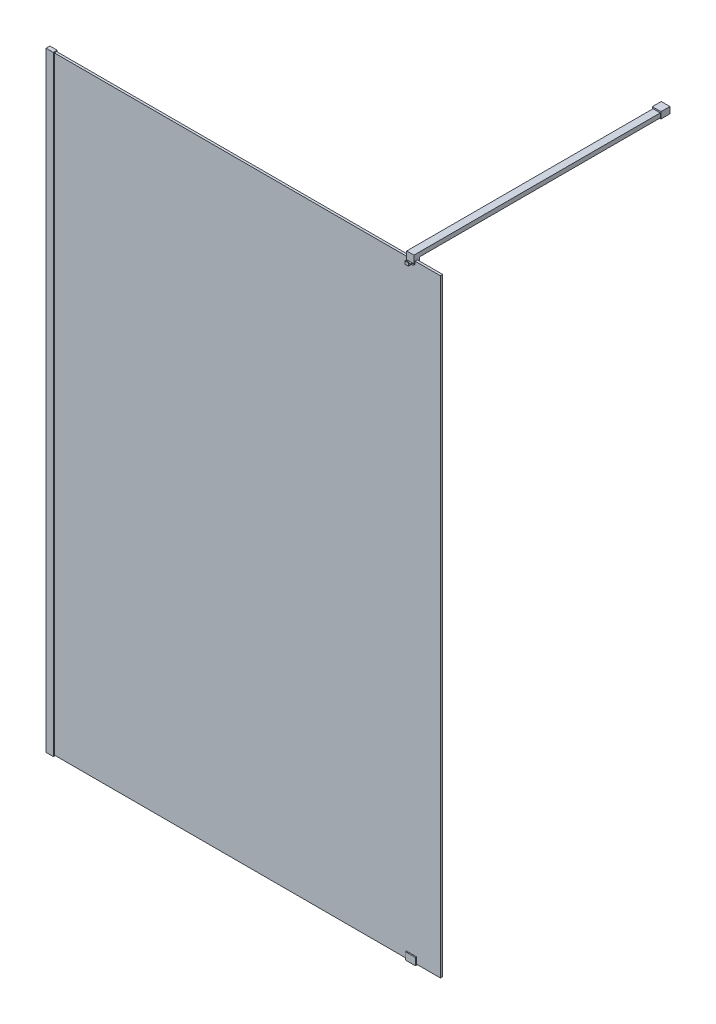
from build123d import *

# Parameters (mm, degrees)
DODANIE_WYCI_GNI_CIE1_DEPTH     = 2100
SZKIC2_W                        = 1347
SZKIC2_H                        = 8
DODANIE_WYCI_GNI_CIE2_DEPTH     = 2100
SZKIC4_W                        = 25
SZKIC4_H                        = 13.3
DODANIE_WYCI_GNI_CIE3_DEPTH     = 3
SZKIC5_W                        = 25
SZKIC5_H                        = 13.3
DODANIE_WYCI_GNI_CIE4_DEPTH     = 3
DODANIE_WYCI_GNI_CIE5_DEPTH     = 17.5
DODANIE_WYCI_GNI_CIE6_DEPTH     = 12.5
WYTNIJ_WYCI_GNI_CIE1_DEPTH      = 2504.671656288
WYTNIJ_WYCI_GNI_CIE1_DEPTH_BACK = 2504.671656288
SZKIC10_W                       = 25
SZKIC10_H                       = 861.63
DODANIE_WYCI_GNI_CIE7_DEPTH     = 15
SZKIC14_W                       = 30
SZKIC14_H                       = 22
DODANIE_WYCI_GNI_CIE8_DEPTH     = 31


with BuildPart() as part:
    # Szkic1 → Dodanie-wyci_gni_cie1 (new body)
    with BuildSketch(Plane(origin=(0, 0, 0), x_dir=(1, 0, 0), z_dir=(0, 1, 0))):
        Polygon((0, 0), (0, 13.3), (25, 13.3), (25, 11.4), (11.45, 11.4), (11.45, 3.4), (25, 3.4), (25, 0), align=None)
    extrude(amount=DODANIE_WYCI_GNI_CIE1_DEPTH)

    # Szkic4 → Dodanie-wyci_gni_cie3 (add)
    with BuildSketch(Plane(origin=(0, 2100, 0), x_dir=(1, 0, 0), z_dir=(0, 1, 0))):
        with Locations((12.5, 6.65)):
            Rectangle(SZKIC4_W, SZKIC4_H)
    extrude(amount=DODANIE_WYCI_GNI_CIE3_DEPTH)

    # Szkic5 → Dodanie-wyci_gni_cie4 (add)
    with BuildSketch(Plane.XZ):
        with Locations((12.5, -6.65)):
            Rectangle(SZKIC5_W, SZKIC5_H)
    extrude(amount=DODANIE_WYCI_GNI_CIE4_DEPTH)


with BuildPart() as body_2:
    # Szkic2 → Dodanie-wyci_gni_cie2 (new body)
    with BuildSketch(Plane.XZ):
        with Locations((684.95, -7.4)):
            Rectangle(SZKIC2_W, SZKIC2_H)
    extrude(amount=-DODANIE_WYCI_GNI_CIE2_DEPTH)


with BuildPart() as body_3:
    # Szkic6 → Dodanie-wyci_gni_cie5 (new, symmetric)
    with BuildSketch(Plane(origin=(1258.45, 0, 0), x_dir=(0, 0, -1), z_dir=(1, 0, 0))):
        Polygon((11.4, 22), (15.75, 22), (15.75, -3), (-0.35, -3), (-0.35, 22), (3.4, 22), (3.4, 0), (11.4, 0), align=None)
    extrude(amount=DODANIE_WYCI_GNI_CIE5_DEPTH, both=True)


with BuildPart() as body_4:
    # Szkic7 → Dodanie-wyci_gni_cie6 (new, symmetric)
    with BuildSketch(Plane(origin=(1258.45, 0, 0), x_dir=(0, 0, -1), z_dir=(1, 0, 0))):
        Polygon((-0.6, 2120), (19.4, 2120), (19.4, 2090), (11.4, 2090), (11.4, 2100), (3.4, 2100), (3.4, 2090), (-13.37, 2090), (-13.37, 2100), (-10.37, 2100), (-9.845068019, 2094), (-0.6, 2094), align=None)
    extrude(amount=DODANIE_WYCI_GNI_CIE6_DEPTH, both=True)

    # Szkic8 → Wytnij-wyci_gni_cie1 (cut, two sides: drawn at the far end of the back side and taken through both)
    with BuildSketch(Plane(origin=(0, 2100, 0), x_dir=(1, 0, 0), z_dir=(0, 1, 0)).offset(-WYTNIJ_WYCI_GNI_CIE1_DEPTH_BACK)):
        Polygon((-1067.142061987, 1078.012542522), (1245.95, -0.6), (1252.45, -3.630999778), (1252.45, -13.37), (1264.45, -13.37), (1264.45, -3.630999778), (1270.95, -0.6), (3584.042061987, 1078.012542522), (3584.042061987, -4026.416868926), (-1067.142061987, -4026.416868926), align=None)
    extrude(amount=WYTNIJ_WYCI_GNI_CIE1_DEPTH + WYTNIJ_WYCI_GNI_CIE1_DEPTH_BACK, mode=Mode.SUBTRACT)

    # Szkic10 → Dodanie-wyci_gni_cie7 (add)
    with BuildSketch(Plane(origin=(0, 2120, 0), x_dir=(1, 0, 0), z_dir=(0, 1, 0))):
        with Locations((1258.45, 450.215)):
            Rectangle(SZKIC10_W, SZKIC10_H)
    extrude(amount=-DODANIE_WYCI_GNI_CIE7_DEPTH)

    # Szkic14 → Dodanie-wyci_gni_cie8 (add)
    with BuildSketch(Plane(origin=(0, 0, -881.03), x_dir=(-1, 0, 0), z_dir=(0, 0, -1))):
        with Locations((-1258.45, 2114)):
            Rectangle(SZKIC14_W, SZKIC14_H)
    extrude(amount=-DODANIE_WYCI_GNI_CIE8_DEPTH)


solid = Compound([part.part, body_2.part, body_3.part, body_4.part])
